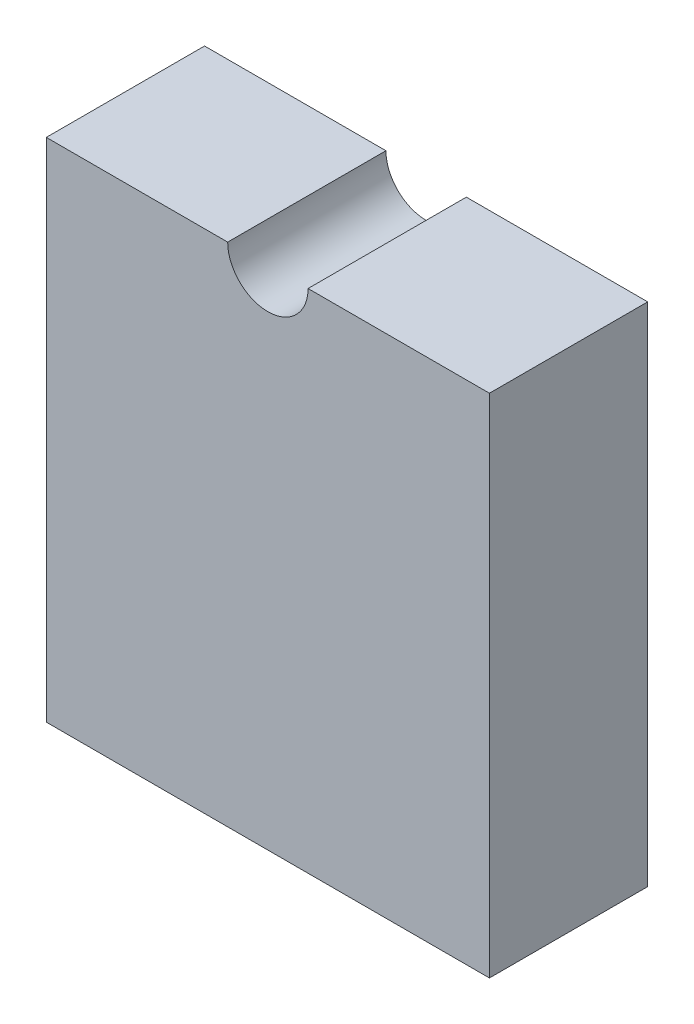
ISO-10303-21;
HEADER;
FILE_DESCRIPTION(('STEP AP214'),'2;1');
FILE_NAME('part.step','',(''),(''),'','','');
FILE_SCHEMA(('AUTOMOTIVE_DESIGN { 1 0 10303 214 1 1 1 1 }'));
ENDSEC;
DATA;
#1=APPLICATION_CONTEXT('core data for automotive mechanical design processes');
#2=APPLICATION_PROTOCOL_DEFINITION('international standard','automotive_design',2000,#1);
#3=PRODUCT_CONTEXT('',#1,'mechanical');
#4=PRODUCT('Part','Part','',(#3));
#5=PRODUCT_RELATED_PRODUCT_CATEGORY('part','',(#4));
#6=PRODUCT_DEFINITION_FORMATION('','',#4);
#7=PRODUCT_DEFINITION_CONTEXT('part definition',#1,'design');
#8=PRODUCT_DEFINITION('design','',#6,#7);
#9=PRODUCT_DEFINITION_SHAPE('','',#8);
#10=(LENGTH_UNIT() NAMED_UNIT(*) SI_UNIT(.MILLI.,.METRE.));
#11=(NAMED_UNIT(*) PLANE_ANGLE_UNIT() SI_UNIT($,.RADIAN.));
#12=(NAMED_UNIT(*) SI_UNIT($,.STERADIAN.) SOLID_ANGLE_UNIT());
#13=UNCERTAINTY_MEASURE_WITH_UNIT(LENGTH_MEASURE(1.E-05),#10,'distance_accuracy_value','');
#14=(GEOMETRIC_REPRESENTATION_CONTEXT(3) GLOBAL_UNCERTAINTY_ASSIGNED_CONTEXT((#13)) GLOBAL_UNIT_ASSIGNED_CONTEXT((#10,
#11,#12)) REPRESENTATION_CONTEXT('',''));
#15=CARTESIAN_POINT('',(0.,0.,0.));
#16=DIRECTION('',(0.,0.,1.));
#17=DIRECTION('',(1.,0.,0.));
#18=AXIS2_PLACEMENT_3D('',#15,#16,#17);
#19=CARTESIAN_POINT('',(0.,-50.,0.));
#20=DIRECTION('',(0.,1.,0.));
#21=DIRECTION('',(0.,0.,1.));
#22=AXIS2_PLACEMENT_3D('',#19,#20,#21);
#23=CYLINDRICAL_SURFACE('',#22,15.);
#24=CARTESIAN_POINT('',(0.,0.,0.));
#25=DIRECTION('',(0.,1.,0.));
#26=DIRECTION('',(0.,0.,1.));
#27=AXIS2_PLACEMENT_3D('',#24,#25,#26);
#28=CIRCLE('',#27,15.);
#29=CARTESIAN_POINT('',(-15.,0.,0.));
#30=VERTEX_POINT('',#29);
#31=CARTESIAN_POINT('',(15.,0.,0.));
#32=VERTEX_POINT('',#31);
#33=EDGE_CURVE('E141',#30,#32,#28,.T.);
#34=ORIENTED_EDGE('',*,*,#33,.T.);
#35=DIRECTION('',(0.,1.,0.));
#36=VECTOR('',#35,1.);
#37=CARTESIAN_POINT('',(15.,-50.,0.));
#38=LINE('',#37,#36);
#39=CARTESIAN_POINT('',(15.,-50.,0.));
#40=VERTEX_POINT('',#39);
#41=EDGE_CURVE('E11',#40,#32,#38,.T.);
#42=ORIENTED_EDGE('',*,*,#41,.F.);
#43=CARTESIAN_POINT('',(0.,-50.,0.));
#44=DIRECTION('',(0.,1.,0.));
#45=DIRECTION('',(0.,0.,1.));
#46=AXIS2_PLACEMENT_3D('',#43,#44,#45);
#47=CIRCLE('',#46,15.);
#48=CARTESIAN_POINT('',(-15.,-50.,0.));
#49=VERTEX_POINT('',#48);
#50=EDGE_CURVE('E138',#49,#40,#47,.T.);
#51=ORIENTED_EDGE('',*,*,#50,.F.);
#52=DIRECTION('',(0.,1.,0.));
#53=VECTOR('',#52,1.);
#54=CARTESIAN_POINT('',(-15.,-50.,0.));
#55=LINE('',#54,#53);
#56=EDGE_CURVE('E44',#49,#30,#55,.T.);
#57=ORIENTED_EDGE('',*,*,#56,.T.);
#58=EDGE_LOOP('',(#34,#42,#51,#57));
#59=FACE_BOUND('',#58,.T.);
#60=ADVANCED_FACE('F41',(#59),#23,.F.);
#61=CARTESIAN_POINT('',(0.,-50.,0.));
#62=DIRECTION('',(0.,0.,1.));
#63=DIRECTION('',(1.,0.,0.));
#64=AXIS2_PLACEMENT_3D('',#61,#62,#63);
#65=PLANE('',#64);
#66=ORIENTED_EDGE('',*,*,#41,.T.);
#67=DIRECTION('',(1.,0.,0.));
#68=VECTOR('',#67,1.);
#69=CARTESIAN_POINT('',(0.,0.,0.));
#70=LINE('',#69,#68);
#71=EDGE_CURVE('E137',#30,#32,#70,.T.);
#72=ORIENTED_EDGE('',*,*,#71,.F.);
#73=ORIENTED_EDGE('',*,*,#56,.F.);
#74=DIRECTION('',(1.,0.,0.));
#75=VECTOR('',#74,1.);
#76=CARTESIAN_POINT('',(0.,-50.,0.));
#77=LINE('',#76,#75);
#78=CARTESIAN_POINT('',(-35.,-50.,0.));
#79=VERTEX_POINT('',#78);
#80=EDGE_CURVE('E140',#79,#49,#77,.T.);
#81=ORIENTED_EDGE('',*,*,#80,.F.);
#82=DIRECTION('',(0.,1.,0.));
#83=VECTOR('',#82,1.);
#84=CARTESIAN_POINT('',(-35.,-50.,0.));
#85=LINE('',#84,#83);
#86=CARTESIAN_POINT('',(-35.,30.,0.));
#87=VERTEX_POINT('',#86);
#88=EDGE_CURVE('E157',#79,#87,#85,.T.);
#89=ORIENTED_EDGE('',*,*,#88,.T.);
#90=DIRECTION('',(-1.,0.,0.));
#91=VECTOR('',#90,1.);
#92=CARTESIAN_POINT('',(0.,30.,0.));
#93=LINE('',#92,#91);
#94=CARTESIAN_POINT('',(-6.35,30.,0.));
#95=VERTEX_POINT('',#94);
#96=EDGE_CURVE('E131',#95,#87,#93,.T.);
#97=ORIENTED_EDGE('',*,*,#96,.F.);
#98=CARTESIAN_POINT('',(0.,30.,0.));
#99=DIRECTION('',(0.,0.,1.));
#100=DIRECTION('',(1.,0.,0.));
#101=AXIS2_PLACEMENT_3D('',#98,#99,#100);
#102=CIRCLE('',#101,6.35);
#103=CARTESIAN_POINT('',(6.35,30.,0.));
#104=VERTEX_POINT('',#103);
#105=EDGE_CURVE('E109',#104,#95,#102,.F.);
#106=ORIENTED_EDGE('',*,*,#105,.F.);
#107=DIRECTION('',(-1.,0.,0.));
#108=VECTOR('',#107,1.);
#109=CARTESIAN_POINT('',(0.,30.,0.));
#110=LINE('',#109,#108);
#111=CARTESIAN_POINT('',(35.,30.,0.));
#112=VERTEX_POINT('',#111);
#113=EDGE_CURVE('E172',#112,#104,#110,.T.);
#114=ORIENTED_EDGE('',*,*,#113,.F.);
#115=DIRECTION('',(0.,1.,0.));
#116=VECTOR('',#115,1.);
#117=CARTESIAN_POINT('',(35.,-50.,0.));
#118=LINE('',#117,#116);
#119=CARTESIAN_POINT('',(35.,-50.,0.));
#120=VERTEX_POINT('',#119);
#121=EDGE_CURVE('E50',#120,#112,#118,.T.);
#122=ORIENTED_EDGE('',*,*,#121,.F.);
#123=EDGE_CURVE('E57',#40,#120,#77,.T.);
#124=ORIENTED_EDGE('',*,*,#123,.F.);
#125=EDGE_LOOP('',(#66,#72,#73,#81,#89,#97,#106,#114,#122,#124));
#126=FACE_BOUND('',#125,.T.);
#127=ADVANCED_FACE('F170',(#126),#65,.F.);
#128=CARTESIAN_POINT('',(35.,-50.,0.));
#129=DIRECTION('',(-1.,0.,0.));
#130=DIRECTION('',(0.,0.,1.));
#131=AXIS2_PLACEMENT_3D('',#128,#129,#130);
#132=PLANE('',#131);
#133=ORIENTED_EDGE('',*,*,#121,.T.);
#134=DIRECTION('',(0.,0.,1.));
#135=VECTOR('',#134,1.);
#136=CARTESIAN_POINT('',(35.,30.,-76.1577310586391));
#137=LINE('',#136,#135);
#138=CARTESIAN_POINT('',(35.,30.,25.));
#139=VERTEX_POINT('',#138);
#140=EDGE_CURVE('E132',#112,#139,#137,.T.);
#141=ORIENTED_EDGE('',*,*,#140,.T.);
#142=DIRECTION('',(0.,1.,0.));
#143=VECTOR('',#142,1.);
#144=CARTESIAN_POINT('',(35.,-50.,25.));
#145=LINE('',#144,#143);
#146=CARTESIAN_POINT('',(35.,-50.,25.));
#147=VERTEX_POINT('',#146);
#148=EDGE_CURVE('E154',#147,#139,#145,.T.);
#149=ORIENTED_EDGE('',*,*,#148,.F.);
#150=DIRECTION('',(0.,0.,1.));
#151=VECTOR('',#150,1.);
#152=CARTESIAN_POINT('',(35.,-50.,0.));
#153=LINE('',#152,#151);
#154=EDGE_CURVE('E149',#120,#147,#153,.T.);
#155=ORIENTED_EDGE('',*,*,#154,.F.);
#156=EDGE_LOOP('',(#133,#141,#149,#155));
#157=FACE_BOUND('',#156,.T.);
#158=ADVANCED_FACE('F175',(#157),#132,.F.);
#159=CARTESIAN_POINT('',(0.,-50.,25.));
#160=DIRECTION('',(0.,0.,1.));
#161=DIRECTION('',(1.,0.,0.));
#162=AXIS2_PLACEMENT_3D('',#159,#160,#161);
#163=PLANE('',#162);
#164=ORIENTED_EDGE('',*,*,#148,.T.);
#165=DIRECTION('',(1.,0.,0.));
#166=VECTOR('',#165,1.);
#167=CARTESIAN_POINT('',(0.,30.,25.));
#168=LINE('',#167,#166);
#169=CARTESIAN_POINT('',(6.35,30.,25.));
#170=VERTEX_POINT('',#169);
#171=EDGE_CURVE('E113',#170,#139,#168,.T.);
#172=ORIENTED_EDGE('',*,*,#171,.F.);
#173=CARTESIAN_POINT('',(0.,30.,25.));
#174=DIRECTION('',(0.,0.,1.));
#175=DIRECTION('',(1.,0.,0.));
#176=AXIS2_PLACEMENT_3D('',#173,#174,#175);
#177=CIRCLE('',#176,6.35);
#178=CARTESIAN_POINT('',(-6.35,30.,25.));
#179=VERTEX_POINT('',#178);
#180=EDGE_CURVE('E108',#179,#170,#177,.T.);
#181=ORIENTED_EDGE('',*,*,#180,.F.);
#182=CARTESIAN_POINT('',(-35.,30.,25.));
#183=VERTEX_POINT('',#182);
#184=EDGE_CURVE('E117',#183,#179,#168,.T.);
#185=ORIENTED_EDGE('',*,*,#184,.F.);
#186=DIRECTION('',(0.,1.,0.));
#187=VECTOR('',#186,1.);
#188=CARTESIAN_POINT('',(-35.,-50.,25.));
#189=LINE('',#188,#187);
#190=CARTESIAN_POINT('',(-35.,-50.,25.));
#191=VERTEX_POINT('',#190);
#192=EDGE_CURVE('E156',#191,#183,#189,.T.);
#193=ORIENTED_EDGE('',*,*,#192,.F.);
#194=DIRECTION('',(1.,0.,0.));
#195=VECTOR('',#194,1.);
#196=CARTESIAN_POINT('',(0.,-50.,25.));
#197=LINE('',#196,#195);
#198=EDGE_CURVE('E146',#191,#147,#197,.T.);
#199=ORIENTED_EDGE('',*,*,#198,.T.);
#200=EDGE_LOOP('',(#164,#172,#181,#185,#193,#199));
#201=FACE_BOUND('',#200,.T.);
#202=ADVANCED_FACE('F123',(#201),#163,.T.);
#203=CARTESIAN_POINT('',(-35.,-50.,0.));
#204=DIRECTION('',(-1.,0.,0.));
#205=DIRECTION('',(0.,0.,1.));
#206=AXIS2_PLACEMENT_3D('',#203,#204,#205);
#207=PLANE('',#206);
#208=ORIENTED_EDGE('',*,*,#192,.T.);
#209=DIRECTION('',(0.,0.,1.));
#210=VECTOR('',#209,1.);
#211=CARTESIAN_POINT('',(-35.,30.,-76.1577310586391));
#212=LINE('',#211,#210);
#213=EDGE_CURVE('E112',#87,#183,#212,.T.);
#214=ORIENTED_EDGE('',*,*,#213,.F.);
#215=ORIENTED_EDGE('',*,*,#88,.F.);
#216=DIRECTION('',(0.,0.,1.));
#217=VECTOR('',#216,1.);
#218=CARTESIAN_POINT('',(-35.,-50.,0.));
#219=LINE('',#218,#217);
#220=EDGE_CURVE('E143',#79,#191,#219,.T.);
#221=ORIENTED_EDGE('',*,*,#220,.T.);
#222=EDGE_LOOP('',(#208,#214,#215,#221));
#223=FACE_BOUND('',#222,.T.);
#224=ADVANCED_FACE('F178',(#223),#207,.T.);
#225=CARTESIAN_POINT('',(0.,-50.,0.));
#226=DIRECTION('',(0.,1.,0.));
#227=DIRECTION('',(0.,0.,1.));
#228=AXIS2_PLACEMENT_3D('',#225,#226,#227);
#229=PLANE('',#228);
#230=ORIENTED_EDGE('',*,*,#50,.T.);
#231=ORIENTED_EDGE('',*,*,#123,.T.);
#232=ORIENTED_EDGE('',*,*,#154,.T.);
#233=ORIENTED_EDGE('',*,*,#198,.F.);
#234=ORIENTED_EDGE('',*,*,#220,.F.);
#235=ORIENTED_EDGE('',*,*,#80,.T.);
#236=EDGE_LOOP('',(#230,#231,#232,#233,#234,#235));
#237=FACE_BOUND('',#236,.T.);
#238=ADVANCED_FACE('F164',(#237),#229,.F.);
#239=CARTESIAN_POINT('',(0.,0.,-76.1577310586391));
#240=DIRECTION('',(0.,1.,0.));
#241=DIRECTION('',(0.,0.,1.));
#242=AXIS2_PLACEMENT_3D('',#239,#240,#241);
#243=PLANE('',#242);
#244=ORIENTED_EDGE('',*,*,#33,.F.);
#245=ORIENTED_EDGE('',*,*,#71,.T.);
#246=EDGE_LOOP('',(#244,#245));
#247=FACE_BOUND('',#246,.T.);
#248=ADVANCED_FACE('F182',(#247),#243,.F.);
#249=CARTESIAN_POINT('',(0.,30.,-76.1577310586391));
#250=DIRECTION('',(0.,-1.,0.));
#251=DIRECTION('',(1.,0.,0.));
#252=AXIS2_PLACEMENT_3D('',#249,#250,#251);
#253=PLANE('',#252);
#254=DIRECTION('',(0.,0.,1.));
#255=VECTOR('',#254,1.);
#256=CARTESIAN_POINT('',(-6.35,30.,-76.1577310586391));
#257=LINE('',#256,#255);
#258=EDGE_CURVE('E103',#95,#179,#257,.T.);
#259=ORIENTED_EDGE('',*,*,#258,.F.);
#260=ORIENTED_EDGE('',*,*,#96,.T.);
#261=ORIENTED_EDGE('',*,*,#213,.T.);
#262=ORIENTED_EDGE('',*,*,#184,.T.);
#263=EDGE_LOOP('',(#259,#260,#261,#262));
#264=FACE_BOUND('',#263,.T.);
#265=ADVANCED_FACE('F118',(#264),#253,.F.);
#266=ORIENTED_EDGE('',*,*,#140,.F.);
#267=ORIENTED_EDGE('',*,*,#113,.T.);
#268=DIRECTION('',(0.,0.,1.));
#269=VECTOR('',#268,1.);
#270=CARTESIAN_POINT('',(6.35,30.,-76.1577310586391));
#271=LINE('',#270,#269);
#272=EDGE_CURVE('E129',#104,#170,#271,.T.);
#273=ORIENTED_EDGE('',*,*,#272,.T.);
#274=ORIENTED_EDGE('',*,*,#171,.T.);
#275=EDGE_LOOP('',(#266,#267,#273,#274));
#276=FACE_BOUND('',#275,.T.);
#277=ADVANCED_FACE('F185',(#276),#253,.F.);
#278=CARTESIAN_POINT('',(0.,30.,-76.1577310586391));
#279=DIRECTION('',(0.,0.,1.));
#280=DIRECTION('',(1.,0.,0.));
#281=AXIS2_PLACEMENT_3D('',#278,#279,#280);
#282=CYLINDRICAL_SURFACE('',#281,6.35);
#283=ORIENTED_EDGE('',*,*,#272,.F.);
#284=ORIENTED_EDGE('',*,*,#105,.T.);
#285=ORIENTED_EDGE('',*,*,#258,.T.);
#286=ORIENTED_EDGE('',*,*,#180,.T.);
#287=EDGE_LOOP('',(#283,#284,#285,#286));
#288=FACE_BOUND('',#287,.T.);
#289=ADVANCED_FACE('F106',(#288),#282,.F.);
#290=CLOSED_SHELL('',(#60,#127,#158,#202,#224,#238,#248,#265,#277,#289));
#291=MANIFOLD_SOLID_BREP('B2',#290);
#292=ADVANCED_BREP_SHAPE_REPRESENTATION('',(#18,#291),#14);
#293=SHAPE_DEFINITION_REPRESENTATION(#9,#292);
ENDSEC;
END-ISO-10303-21;
